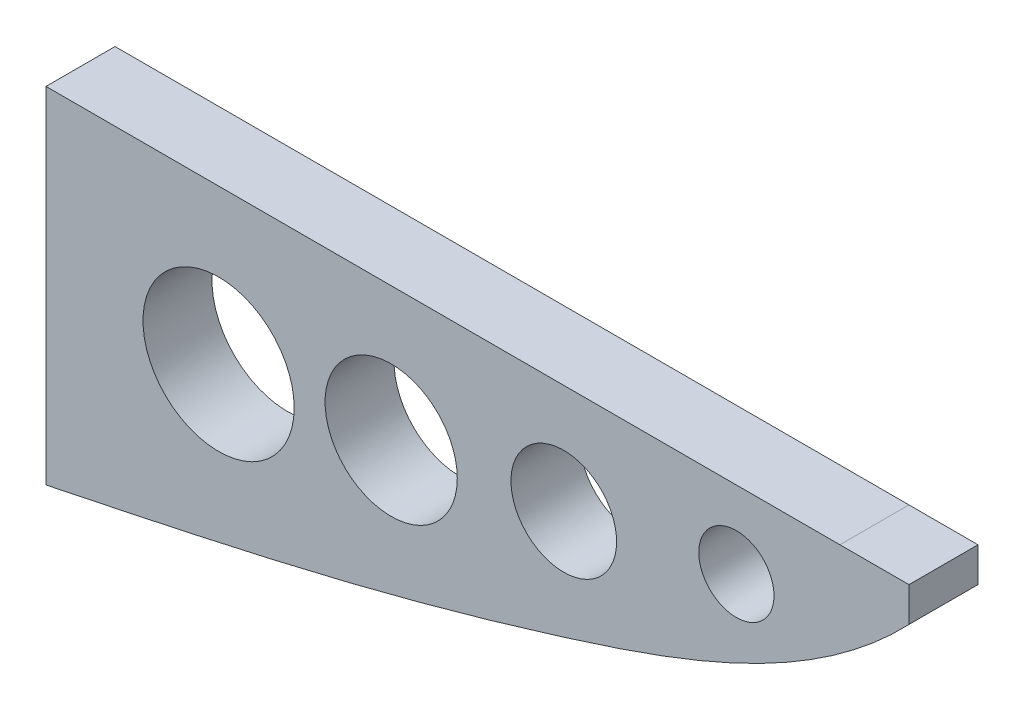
ISO-10303-21;
HEADER;
FILE_DESCRIPTION(('STEP AP214'),'2;1');
FILE_NAME('part.step','',(''),(''),'','','');
FILE_SCHEMA(('AUTOMOTIVE_DESIGN { 1 0 10303 214 1 1 1 1 }'));
ENDSEC;
DATA;
#1=APPLICATION_CONTEXT('core data for automotive mechanical design processes');
#2=APPLICATION_PROTOCOL_DEFINITION('international standard','automotive_design',2000,#1);
#3=PRODUCT_CONTEXT('',#1,'mechanical');
#4=PRODUCT('Part','Part','',(#3));
#5=PRODUCT_RELATED_PRODUCT_CATEGORY('part','',(#4));
#6=PRODUCT_DEFINITION_FORMATION('','',#4);
#7=PRODUCT_DEFINITION_CONTEXT('part definition',#1,'design');
#8=PRODUCT_DEFINITION('design','',#6,#7);
#9=PRODUCT_DEFINITION_SHAPE('','',#8);
#10=(LENGTH_UNIT() NAMED_UNIT(*) SI_UNIT(.MILLI.,.METRE.));
#11=(NAMED_UNIT(*) PLANE_ANGLE_UNIT() SI_UNIT($,.RADIAN.));
#12=(NAMED_UNIT(*) SI_UNIT($,.STERADIAN.) SOLID_ANGLE_UNIT());
#13=UNCERTAINTY_MEASURE_WITH_UNIT(LENGTH_MEASURE(1.E-05),#10,'distance_accuracy_value','');
#14=(GEOMETRIC_REPRESENTATION_CONTEXT(3) GLOBAL_UNCERTAINTY_ASSIGNED_CONTEXT((#13)) GLOBAL_UNIT_ASSIGNED_CONTEXT((#10,
#11,#12)) REPRESENTATION_CONTEXT('',''));
#15=CARTESIAN_POINT('',(0.,0.,0.));
#16=DIRECTION('',(0.,0.,1.));
#17=DIRECTION('',(1.,0.,0.));
#18=AXIS2_PLACEMENT_3D('',#15,#16,#17);
#19=CARTESIAN_POINT('',(0.,50.,20.));
#20=DIRECTION('',(0.,1.,0.));
#21=DIRECTION('',(0.,0.,1.));
#22=AXIS2_PLACEMENT_3D('',#19,#20,#21);
#23=PLANE('',#22);
#24=DIRECTION('',(1.,0.,0.));
#25=VECTOR('',#24,1.);
#26=CARTESIAN_POINT('',(0.,50.,0.));
#27=LINE('',#26,#25);
#28=CARTESIAN_POINT('',(230.,50.,0.));
#29=VERTEX_POINT('',#28);
#30=CARTESIAN_POINT('',(250.,50.,0.));
#31=VERTEX_POINT('',#30);
#32=EDGE_CURVE('E129',#29,#31,#27,.T.);
#33=ORIENTED_EDGE('',*,*,#32,.F.);
#34=DIRECTION('',(0.,0.,1.));
#35=VECTOR('',#34,1.);
#36=CARTESIAN_POINT('',(230.,50.,20.));
#37=LINE('',#36,#35);
#38=CARTESIAN_POINT('',(230.,50.,20.));
#39=VERTEX_POINT('',#38);
#40=EDGE_CURVE('E11',#29,#39,#37,.T.);
#41=ORIENTED_EDGE('',*,*,#40,.T.);
#42=DIRECTION('',(1.,0.,0.));
#43=VECTOR('',#42,1.);
#44=CARTESIAN_POINT('',(0.,50.,20.));
#45=LINE('',#44,#43);
#46=CARTESIAN_POINT('',(250.,50.,20.));
#47=VERTEX_POINT('',#46);
#48=EDGE_CURVE('E109',#39,#47,#45,.T.);
#49=ORIENTED_EDGE('',*,*,#48,.T.);
#50=DIRECTION('',(0.,0.,-1.));
#51=VECTOR('',#50,1.);
#52=CARTESIAN_POINT('',(250.,50.,20.));
#53=LINE('',#52,#51);
#54=EDGE_CURVE('E105',#47,#31,#53,.T.);
#55=ORIENTED_EDGE('',*,*,#54,.T.);
#56=EDGE_LOOP('',(#33,#41,#49,#55));
#57=FACE_BOUND('',#56,.T.);
#58=ADVANCED_FACE('F42',(#57),#23,.T.);
#59=CARTESIAN_POINT('',(0.,-50.,20.));
#60=CARTESIAN_POINT('',(33.4199486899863,-43.0608583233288,20.));
#61=CARTESIAN_POINT('',(83.9632555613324,-32.5541977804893,20.));
#62=CARTESIAN_POINT('',(169.944017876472,-7.88320989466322,20.));
#63=CARTESIAN_POINT('',(222.615387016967,11.374413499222,20.));
#64=CARTESIAN_POINT('',(250.,40.,20.));
#65=B_SPLINE_CURVE_WITH_KNOTS('',3,(#59,#60,#61,#62,#63,#64),.UNSPECIFIED.,.F.,.F.,(4,1,1,4),
(0.,0.381514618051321,0.575066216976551,1.),.UNSPECIFIED.);
#66=DIRECTION('',(0.,0.,-1.));
#67=VECTOR('',#66,1.);
#68=SURFACE_OF_LINEAR_EXTRUSION('',#65,#67);
#69=CARTESIAN_POINT('',(0.,-50.,0.));
#70=CARTESIAN_POINT('',(33.4199486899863,-43.0608583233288,0.));
#71=CARTESIAN_POINT('',(83.9632555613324,-32.5541977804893,0.));
#72=CARTESIAN_POINT('',(169.944017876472,-7.88320989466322,0.));
#73=CARTESIAN_POINT('',(222.615387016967,11.374413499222,0.));
#74=CARTESIAN_POINT('',(250.,40.,0.));
#75=B_SPLINE_CURVE_WITH_KNOTS('',3,(#69,#70,#71,#72,#73,#74),.UNSPECIFIED.,.F.,.F.,(4,1,1,4),
(0.,0.381514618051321,0.575066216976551,1.),.UNSPECIFIED.);
#76=CARTESIAN_POINT('',(0.,-50.,0.));
#77=VERTEX_POINT('',#76);
#78=CARTESIAN_POINT('',(250.,40.,0.));
#79=VERTEX_POINT('',#78);
#80=EDGE_CURVE('E101',#77,#79,#75,.T.);
#81=ORIENTED_EDGE('',*,*,#80,.T.);
#82=DIRECTION('',(0.,0.,-1.));
#83=VECTOR('',#82,1.);
#84=CARTESIAN_POINT('',(250.,40.,20.));
#85=LINE('',#84,#83);
#86=CARTESIAN_POINT('',(250.,40.,20.));
#87=VERTEX_POINT('',#86);
#88=EDGE_CURVE('E52',#87,#79,#85,.T.);
#89=ORIENTED_EDGE('',*,*,#88,.F.);
#90=CARTESIAN_POINT('',(0.,-50.,20.));
#91=VERTEX_POINT('',#90);
#92=EDGE_CURVE('E89',#91,#87,#65,.T.);
#93=ORIENTED_EDGE('',*,*,#92,.F.);
#94=DIRECTION('',(0.,0.,-1.));
#95=VECTOR('',#94,1.);
#96=CARTESIAN_POINT('',(0.,-50.,20.));
#97=LINE('',#96,#95);
#98=EDGE_CURVE('E119',#91,#77,#97,.T.);
#99=ORIENTED_EDGE('',*,*,#98,.T.);
#100=EDGE_LOOP('',(#81,#89,#93,#99));
#101=FACE_BOUND('',#100,.T.);
#102=ADVANCED_FACE('F44',(#101),#68,.F.);
#103=CARTESIAN_POINT('',(250.,50.,20.));
#104=DIRECTION('',(1.,0.,0.));
#105=DIRECTION('',(0.,0.,-1.));
#106=AXIS2_PLACEMENT_3D('',#103,#104,#105);
#107=PLANE('',#106);
#108=DIRECTION('',(0.,-1.,0.));
#109=VECTOR('',#108,1.);
#110=CARTESIAN_POINT('',(250.,50.,0.));
#111=LINE('',#110,#109);
#112=EDGE_CURVE('E123',#31,#79,#111,.T.);
#113=ORIENTED_EDGE('',*,*,#112,.F.);
#114=ORIENTED_EDGE('',*,*,#54,.F.);
#115=DIRECTION('',(0.,-1.,0.));
#116=VECTOR('',#115,1.);
#117=CARTESIAN_POINT('',(250.,50.,20.));
#118=LINE('',#117,#116);
#119=EDGE_CURVE('E93',#47,#87,#118,.T.);
#120=ORIENTED_EDGE('',*,*,#119,.T.);
#121=ORIENTED_EDGE('',*,*,#88,.T.);
#122=EDGE_LOOP('',(#113,#114,#120,#121));
#123=FACE_BOUND('',#122,.T.);
#124=ADVANCED_FACE('F107',(#123),#107,.T.);
#125=ORIENTED_EDGE('',*,*,#40,.F.);
#126=CARTESIAN_POINT('',(0.,50.,0.));
#127=VERTEX_POINT('',#126);
#128=EDGE_CURVE('E130',#127,#29,#27,.T.);
#129=ORIENTED_EDGE('',*,*,#128,.F.);
#130=DIRECTION('',(0.,0.,-1.));
#131=VECTOR('',#130,1.);
#132=CARTESIAN_POINT('',(0.,50.,20.));
#133=LINE('',#132,#131);
#134=CARTESIAN_POINT('',(0.,50.,20.));
#135=VERTEX_POINT('',#134);
#136=EDGE_CURVE('E136',#135,#127,#133,.T.);
#137=ORIENTED_EDGE('',*,*,#136,.F.);
#138=EDGE_CURVE('E111',#135,#39,#45,.T.);
#139=ORIENTED_EDGE('',*,*,#138,.T.);
#140=EDGE_LOOP('',(#125,#129,#137,#139));
#141=FACE_BOUND('',#140,.T.);
#142=ADVANCED_FACE('F141',(#141),#23,.T.);
#143=CARTESIAN_POINT('',(0.,-50.,20.));
#144=DIRECTION('',(-1.,0.,0.));
#145=DIRECTION('',(0.,0.,1.));
#146=AXIS2_PLACEMENT_3D('',#143,#144,#145);
#147=PLANE('',#146);
#148=DIRECTION('',(0.,1.,0.));
#149=VECTOR('',#148,1.);
#150=CARTESIAN_POINT('',(0.,-50.,0.));
#151=LINE('',#150,#149);
#152=EDGE_CURVE('E98',#77,#127,#151,.T.);
#153=ORIENTED_EDGE('',*,*,#152,.F.);
#154=ORIENTED_EDGE('',*,*,#98,.F.);
#155=DIRECTION('',(0.,1.,0.));
#156=VECTOR('',#155,1.);
#157=CARTESIAN_POINT('',(0.,-50.,20.));
#158=LINE('',#157,#156);
#159=EDGE_CURVE('E96',#91,#135,#158,.T.);
#160=ORIENTED_EDGE('',*,*,#159,.T.);
#161=ORIENTED_EDGE('',*,*,#136,.T.);
#162=EDGE_LOOP('',(#153,#154,#160,#161));
#163=FACE_BOUND('',#162,.T.);
#164=ADVANCED_FACE('F143',(#163),#147,.T.);
#165=CARTESIAN_POINT('',(130.668210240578,-19.0333420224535,20.));
#166=DIRECTION('',(0.,0.,-1.));
#167=DIRECTION('',(-1.,0.,0.));
#168=AXIS2_PLACEMENT_3D('',#165,#166,#167);
#169=PLANE('',#168);
#170=CARTESIAN_POINT('',(50.,5.30000000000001,20.));
#171=DIRECTION('',(0.,0.,1.));
#172=DIRECTION('',(1.,0.,0.));
#173=AXIS2_PLACEMENT_3D('',#170,#171,#172);
#174=CIRCLE('',#173,21.9);
#175=CARTESIAN_POINT('',(71.9,5.30000000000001,20.));
#176=VERTEX_POINT('',#175);
#177=EDGE_CURVE('E237',#176,#176,#174,.T.);
#178=ORIENTED_EDGE('',*,*,#177,.F.);
#179=EDGE_LOOP('',(#178));
#180=FACE_BOUND('',#179,.T.);
#181=CARTESIAN_POINT('',(100.,11.25,20.));
#182=DIRECTION('',(0.,0.,1.));
#183=DIRECTION('',(1.,0.,0.));
#184=AXIS2_PLACEMENT_3D('',#181,#182,#183);
#185=CIRCLE('',#184,19.15);
#186=CARTESIAN_POINT('',(119.15,11.25,20.));
#187=VERTEX_POINT('',#186);
#188=EDGE_CURVE('E239',#187,#187,#185,.T.);
#189=ORIENTED_EDGE('',*,*,#188,.F.);
#190=EDGE_LOOP('',(#189));
#191=FACE_BOUND('',#190,.T.);
#192=CARTESIAN_POINT('',(150.,18.4,20.));
#193=DIRECTION('',(0.,0.,1.));
#194=DIRECTION('',(1.,0.,0.));
#195=AXIS2_PLACEMENT_3D('',#192,#193,#194);
#196=CIRCLE('',#195,15.3);
#197=CARTESIAN_POINT('',(165.3,18.4,20.));
#198=VERTEX_POINT('',#197);
#199=EDGE_CURVE('E245',#198,#198,#196,.T.);
#200=ORIENTED_EDGE('',*,*,#199,.F.);
#201=EDGE_LOOP('',(#200));
#202=FACE_BOUND('',#201,.T.);
#203=CARTESIAN_POINT('',(200.,27.65,20.));
#204=DIRECTION('',(0.,0.,1.));
#205=DIRECTION('',(1.,0.,0.));
#206=AXIS2_PLACEMENT_3D('',#203,#204,#205);
#207=CIRCLE('',#206,10.9);
#208=CARTESIAN_POINT('',(210.9,27.65,20.));
#209=VERTEX_POINT('',#208);
#210=EDGE_CURVE('E251',#209,#209,#207,.T.);
#211=ORIENTED_EDGE('',*,*,#210,.F.);
#212=EDGE_LOOP('',(#211));
#213=FACE_BOUND('',#212,.T.);
#214=ORIENTED_EDGE('',*,*,#92,.T.);
#215=ORIENTED_EDGE('',*,*,#119,.F.);
#216=ORIENTED_EDGE('',*,*,#48,.F.);
#217=ORIENTED_EDGE('',*,*,#138,.F.);
#218=ORIENTED_EDGE('',*,*,#159,.F.);
#219=EDGE_LOOP('',(#214,#215,#216,#217,#218));
#220=FACE_BOUND('',#219,.T.);
#221=ADVANCED_FACE('F91',(#180,#191,#202,#213,#220),#169,.F.);
#222=CARTESIAN_POINT('',(130.668210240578,-19.0333420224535,0.));
#223=DIRECTION('',(0.,0.,-1.));
#224=DIRECTION('',(-1.,0.,0.));
#225=AXIS2_PLACEMENT_3D('',#222,#223,#224);
#226=PLANE('',#225);
#227=CARTESIAN_POINT('',(50.,5.30000000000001,0.));
#228=DIRECTION('',(0.,0.,1.));
#229=DIRECTION('',(1.,0.,0.));
#230=AXIS2_PLACEMENT_3D('',#227,#228,#229);
#231=CIRCLE('',#230,21.9);
#232=CARTESIAN_POINT('',(71.9,5.30000000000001,0.));
#233=VERTEX_POINT('',#232);
#234=EDGE_CURVE('E234',#233,#233,#231,.T.);
#235=ORIENTED_EDGE('',*,*,#234,.T.);
#236=EDGE_LOOP('',(#235));
#237=FACE_BOUND('',#236,.T.);
#238=CARTESIAN_POINT('',(100.,11.25,0.));
#239=DIRECTION('',(0.,0.,1.));
#240=DIRECTION('',(1.,0.,0.));
#241=AXIS2_PLACEMENT_3D('',#238,#239,#240);
#242=CIRCLE('',#241,19.15);
#243=CARTESIAN_POINT('',(119.15,11.25,0.));
#244=VERTEX_POINT('',#243);
#245=EDGE_CURVE('E242',#244,#244,#242,.T.);
#246=ORIENTED_EDGE('',*,*,#245,.T.);
#247=EDGE_LOOP('',(#246));
#248=FACE_BOUND('',#247,.T.);
#249=CARTESIAN_POINT('',(150.,18.4,0.));
#250=DIRECTION('',(0.,0.,1.));
#251=DIRECTION('',(1.,0.,0.));
#252=AXIS2_PLACEMENT_3D('',#249,#250,#251);
#253=CIRCLE('',#252,15.3);
#254=CARTESIAN_POINT('',(165.3,18.4,0.));
#255=VERTEX_POINT('',#254);
#256=EDGE_CURVE('E248',#255,#255,#253,.T.);
#257=ORIENTED_EDGE('',*,*,#256,.T.);
#258=EDGE_LOOP('',(#257));
#259=FACE_BOUND('',#258,.T.);
#260=CARTESIAN_POINT('',(200.,27.65,0.));
#261=DIRECTION('',(0.,0.,1.));
#262=DIRECTION('',(1.,0.,0.));
#263=AXIS2_PLACEMENT_3D('',#260,#261,#262);
#264=CIRCLE('',#263,10.9);
#265=CARTESIAN_POINT('',(210.9,27.65,0.));
#266=VERTEX_POINT('',#265);
#267=EDGE_CURVE('E124',#266,#266,#264,.T.);
#268=ORIENTED_EDGE('',*,*,#267,.T.);
#269=EDGE_LOOP('',(#268));
#270=FACE_BOUND('',#269,.T.);
#271=ORIENTED_EDGE('',*,*,#80,.F.);
#272=ORIENTED_EDGE('',*,*,#152,.T.);
#273=ORIENTED_EDGE('',*,*,#128,.T.);
#274=ORIENTED_EDGE('',*,*,#32,.T.);
#275=ORIENTED_EDGE('',*,*,#112,.T.);
#276=EDGE_LOOP('',(#271,#272,#273,#274,#275));
#277=FACE_BOUND('',#276,.T.);
#278=ADVANCED_FACE('F139',(#237,#248,#259,#270,#277),#226,.T.);
#279=CARTESIAN_POINT('',(200.,27.65,0.));
#280=DIRECTION('',(0.,0.,1.));
#281=DIRECTION('',(1.,0.,0.));
#282=AXIS2_PLACEMENT_3D('',#279,#280,#281);
#283=CYLINDRICAL_SURFACE('',#282,10.9);
#284=ORIENTED_EDGE('',*,*,#267,.F.);
#285=EDGE_LOOP('',(#284));
#286=FACE_BOUND('',#285,.T.);
#287=ORIENTED_EDGE('',*,*,#210,.T.);
#288=EDGE_LOOP('',(#287));
#289=FACE_BOUND('',#288,.T.);
#290=ADVANCED_FACE('F188',(#286,#289),#283,.F.);
#291=CARTESIAN_POINT('',(150.,18.4,0.));
#292=DIRECTION('',(0.,0.,1.));
#293=DIRECTION('',(1.,0.,0.));
#294=AXIS2_PLACEMENT_3D('',#291,#292,#293);
#295=CYLINDRICAL_SURFACE('',#294,15.3);
#296=ORIENTED_EDGE('',*,*,#256,.F.);
#297=EDGE_LOOP('',(#296));
#298=FACE_BOUND('',#297,.T.);
#299=ORIENTED_EDGE('',*,*,#199,.T.);
#300=EDGE_LOOP('',(#299));
#301=FACE_BOUND('',#300,.T.);
#302=ADVANCED_FACE('F197',(#298,#301),#295,.F.);
#303=CARTESIAN_POINT('',(100.,11.25,0.));
#304=DIRECTION('',(0.,0.,1.));
#305=DIRECTION('',(1.,0.,0.));
#306=AXIS2_PLACEMENT_3D('',#303,#304,#305);
#307=CYLINDRICAL_SURFACE('',#306,19.15);
#308=ORIENTED_EDGE('',*,*,#245,.F.);
#309=EDGE_LOOP('',(#308));
#310=FACE_BOUND('',#309,.T.);
#311=ORIENTED_EDGE('',*,*,#188,.T.);
#312=EDGE_LOOP('',(#311));
#313=FACE_BOUND('',#312,.T.);
#314=ADVANCED_FACE('F207',(#310,#313),#307,.F.);
#315=CARTESIAN_POINT('',(50.,5.30000000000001,0.));
#316=DIRECTION('',(0.,0.,1.));
#317=DIRECTION('',(1.,0.,0.));
#318=AXIS2_PLACEMENT_3D('',#315,#316,#317);
#319=CYLINDRICAL_SURFACE('',#318,21.9);
#320=ORIENTED_EDGE('',*,*,#234,.F.);
#321=EDGE_LOOP('',(#320));
#322=FACE_BOUND('',#321,.T.);
#323=ORIENTED_EDGE('',*,*,#177,.T.);
#324=EDGE_LOOP('',(#323));
#325=FACE_BOUND('',#324,.T.);
#326=ADVANCED_FACE('F217',(#322,#325),#319,.F.);
#327=CLOSED_SHELL('',(#58,#102,#124,#142,#164,#221,#278,#290,#302,#314,#326));
#328=MANIFOLD_SOLID_BREP('B2',#327);
#329=ADVANCED_BREP_SHAPE_REPRESENTATION('',(#18,#328),#14);
#330=SHAPE_DEFINITION_REPRESENTATION(#9,#329);
ENDSEC;
END-ISO-10303-21;
